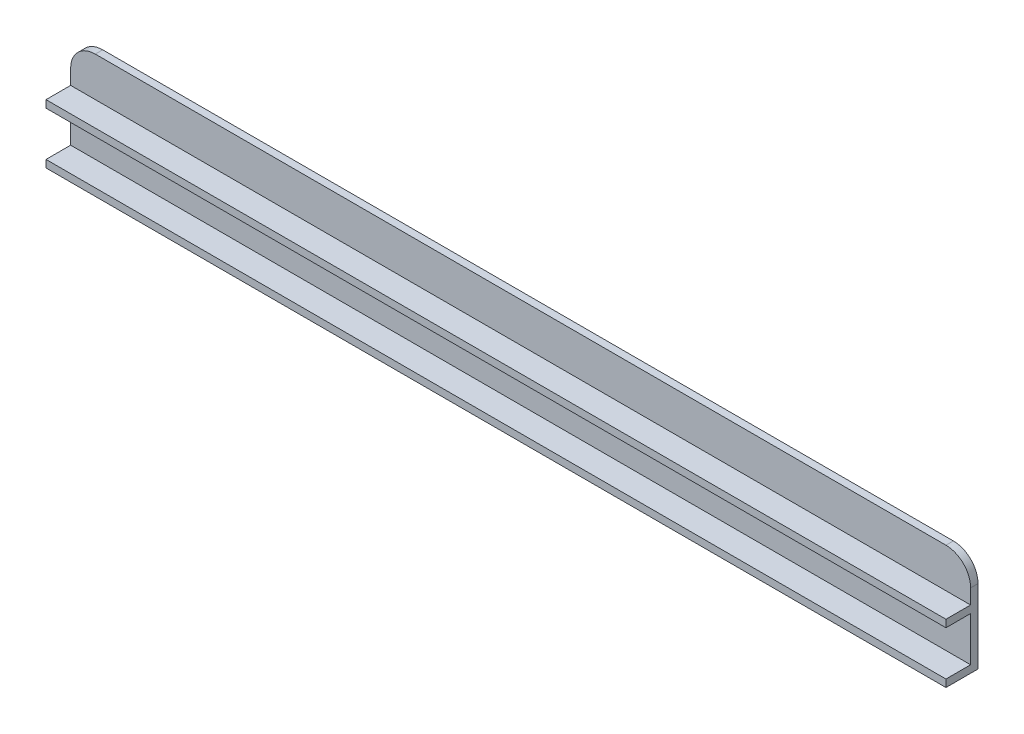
ISO-10303-21;
HEADER;
FILE_DESCRIPTION(('STEP AP214'),'2;1');
FILE_NAME('part.step','',(''),(''),'','','');
FILE_SCHEMA(('AUTOMOTIVE_DESIGN { 1 0 10303 214 1 1 1 1 }'));
ENDSEC;
DATA;
#1=APPLICATION_CONTEXT('core data for automotive mechanical design processes');
#2=APPLICATION_PROTOCOL_DEFINITION('international standard','automotive_design',2000,#1);
#3=PRODUCT_CONTEXT('',#1,'mechanical');
#4=PRODUCT('Part','Part','',(#3));
#5=PRODUCT_RELATED_PRODUCT_CATEGORY('part','',(#4));
#6=PRODUCT_DEFINITION_FORMATION('','',#4);
#7=PRODUCT_DEFINITION_CONTEXT('part definition',#1,'design');
#8=PRODUCT_DEFINITION('design','',#6,#7);
#9=PRODUCT_DEFINITION_SHAPE('','',#8);
#10=(LENGTH_UNIT() NAMED_UNIT(*) SI_UNIT(.MILLI.,.METRE.));
#11=(NAMED_UNIT(*) PLANE_ANGLE_UNIT() SI_UNIT($,.RADIAN.));
#12=(NAMED_UNIT(*) SI_UNIT($,.STERADIAN.) SOLID_ANGLE_UNIT());
#13=UNCERTAINTY_MEASURE_WITH_UNIT(LENGTH_MEASURE(1.E-05),#10,'distance_accuracy_value','');
#14=(GEOMETRIC_REPRESENTATION_CONTEXT(3) GLOBAL_UNCERTAINTY_ASSIGNED_CONTEXT((#13)) GLOBAL_UNIT_ASSIGNED_CONTEXT((#10,
#11,#12)) REPRESENTATION_CONTEXT('',''));
#15=CARTESIAN_POINT('',(0.,0.,0.));
#16=DIRECTION('',(0.,0.,1.));
#17=DIRECTION('',(1.,0.,0.));
#18=AXIS2_PLACEMENT_3D('',#15,#16,#17);
#19=CARTESIAN_POINT('',(156.500000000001,0.,296.499999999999));
#20=DIRECTION('',(1.,0.,0.));
#21=DIRECTION('',(0.,0.,-1.));
#22=AXIS2_PLACEMENT_3D('',#19,#20,#21);
#23=PLANE('',#22);
#24=DIRECTION('',(0.,1.,0.));
#25=VECTOR('',#24,1.);
#26=CARTESIAN_POINT('',(156.5,218.5,144.999999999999));
#27=LINE('',#26,#25);
#28=CARTESIAN_POINT('',(156.5,218.5,144.999999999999));
#29=VERTEX_POINT('',#28);
#30=CARTESIAN_POINT('',(156.5,233.5,144.999999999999));
#31=VERTEX_POINT('',#30);
#32=EDGE_CURVE('E145',#29,#31,#27,.T.);
#33=ORIENTED_EDGE('',*,*,#32,.T.);
#34=DIRECTION('',(0.,0.,1.));
#35=VECTOR('',#34,1.);
#36=CARTESIAN_POINT('',(156.5,233.5,146.499999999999));
#37=LINE('',#36,#35);
#38=CARTESIAN_POINT('',(156.5,233.5,146.499999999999));
#39=VERTEX_POINT('',#38);
#40=EDGE_CURVE('E11',#31,#39,#37,.T.);
#41=ORIENTED_EDGE('',*,*,#40,.T.);
#42=DIRECTION('',(0.,-1.,0.));
#43=VECTOR('',#42,1.);
#44=CARTESIAN_POINT('',(156.5,238.5,146.499999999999));
#45=LINE('',#44,#43);
#46=CARTESIAN_POINT('',(156.5,230.5,146.499999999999));
#47=VERTEX_POINT('',#46);
#48=EDGE_CURVE('E157',#39,#47,#45,.T.);
#49=ORIENTED_EDGE('',*,*,#48,.T.);
#50=DIRECTION('',(0.,0.,1.));
#51=VECTOR('',#50,1.);
#52=CARTESIAN_POINT('',(156.5,230.5,146.499999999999));
#53=LINE('',#52,#51);
#54=CARTESIAN_POINT('',(156.5,230.5,151.499999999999));
#55=VERTEX_POINT('',#54);
#56=EDGE_CURVE('E162',#47,#55,#53,.T.);
#57=ORIENTED_EDGE('',*,*,#56,.T.);
#58=DIRECTION('',(0.,-1.,0.));
#59=VECTOR('',#58,1.);
#60=CARTESIAN_POINT('',(156.5,230.5,151.499999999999));
#61=LINE('',#60,#59);
#62=CARTESIAN_POINT('',(156.5,229.,151.499999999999));
#63=VERTEX_POINT('',#62);
#64=EDGE_CURVE('E167',#55,#63,#61,.T.);
#65=ORIENTED_EDGE('',*,*,#64,.T.);
#66=DIRECTION('',(0.,0.,-1.));
#67=VECTOR('',#66,1.);
#68=CARTESIAN_POINT('',(156.5,229.,151.499999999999));
#69=LINE('',#68,#67);
#70=CARTESIAN_POINT('',(156.5,229.,146.499999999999));
#71=VERTEX_POINT('',#70);
#72=EDGE_CURVE('E172',#63,#71,#69,.T.);
#73=ORIENTED_EDGE('',*,*,#72,.T.);
#74=DIRECTION('',(0.,-1.,0.));
#75=VECTOR('',#74,1.);
#76=CARTESIAN_POINT('',(156.5,229.,146.499999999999));
#77=LINE('',#76,#75);
#78=CARTESIAN_POINT('',(156.5,220.,146.499999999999));
#79=VERTEX_POINT('',#78);
#80=EDGE_CURVE('E177',#71,#79,#77,.T.);
#81=ORIENTED_EDGE('',*,*,#80,.T.);
#82=DIRECTION('',(0.,0.,1.));
#83=VECTOR('',#82,1.);
#84=CARTESIAN_POINT('',(156.5,220.,146.499999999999));
#85=LINE('',#84,#83);
#86=CARTESIAN_POINT('',(156.5,220.,151.499999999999));
#87=VERTEX_POINT('',#86);
#88=EDGE_CURVE('E182',#79,#87,#85,.T.);
#89=ORIENTED_EDGE('',*,*,#88,.T.);
#90=DIRECTION('',(0.,-1.,0.));
#91=VECTOR('',#90,1.);
#92=CARTESIAN_POINT('',(156.5,220.,151.499999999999));
#93=LINE('',#92,#91);
#94=CARTESIAN_POINT('',(156.5,218.5,151.499999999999));
#95=VERTEX_POINT('',#94);
#96=EDGE_CURVE('E187',#87,#95,#93,.T.);
#97=ORIENTED_EDGE('',*,*,#96,.T.);
#98=DIRECTION('',(0.,0.,-1.));
#99=VECTOR('',#98,1.);
#100=CARTESIAN_POINT('',(156.5,218.5,151.499999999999));
#101=LINE('',#100,#99);
#102=EDGE_CURVE('E191',#95,#29,#101,.T.);
#103=ORIENTED_EDGE('',*,*,#102,.T.);
#104=EDGE_LOOP('',(#33,#41,#49,#57,#65,#73,#81,#89,#97,#103));
#105=FACE_BOUND('',#104,.T.);
#106=ADVANCED_FACE('F38',(#105),#23,.T.);
#107=CARTESIAN_POINT('',(-34.5,218.5,145.000000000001));
#108=DIRECTION('',(0.,0.,-1.));
#109=DIRECTION('',(-1.,0.,0.));
#110=AXIS2_PLACEMENT_3D('',#107,#108,#109);
#111=PLANE('',#110);
#112=DIRECTION('',(0.,1.,0.));
#113=VECTOR('',#112,1.);
#114=CARTESIAN_POINT('',(-26.,212.5,145.000000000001));
#115=LINE('',#114,#113);
#116=CARTESIAN_POINT('',(-26.,218.5,145.000000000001));
#117=VERTEX_POINT('',#116);
#118=CARTESIAN_POINT('',(-26.,233.5,145.000000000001));
#119=VERTEX_POINT('',#118);
#120=EDGE_CURVE('E127',#117,#119,#115,.T.);
#121=ORIENTED_EDGE('',*,*,#120,.T.);
#122=CARTESIAN_POINT('',(-21.,233.5,145.000000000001));
#123=DIRECTION('',(0.,0.,-1.));
#124=DIRECTION('',(-1.,0.,0.));
#125=AXIS2_PLACEMENT_3D('',#122,#123,#124);
#126=CIRCLE('',#125,5.);
#127=CARTESIAN_POINT('',(-21.,238.5,145.000000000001));
#128=VERTEX_POINT('',#127);
#129=EDGE_CURVE('E46',#119,#128,#126,.T.);
#130=ORIENTED_EDGE('',*,*,#129,.T.);
#131=DIRECTION('',(1.,0.,0.));
#132=VECTOR('',#131,1.);
#133=CARTESIAN_POINT('',(-34.5,238.5,145.000000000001));
#134=LINE('',#133,#132);
#135=CARTESIAN_POINT('',(151.5,238.5,144.999999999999));
#136=VERTEX_POINT('',#135);
#137=EDGE_CURVE('E148',#128,#136,#134,.T.);
#138=ORIENTED_EDGE('',*,*,#137,.T.);
#139=CARTESIAN_POINT('',(151.5,233.5,144.999999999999));
#140=DIRECTION('',(0.,0.,-1.));
#141=DIRECTION('',(-1.,0.,0.));
#142=AXIS2_PLACEMENT_3D('',#139,#140,#141);
#143=CIRCLE('',#142,5.);
#144=EDGE_CURVE('E53',#136,#31,#143,.T.);
#145=ORIENTED_EDGE('',*,*,#144,.T.);
#146=ORIENTED_EDGE('',*,*,#32,.F.);
#147=DIRECTION('',(1.,0.,0.));
#148=VECTOR('',#147,1.);
#149=CARTESIAN_POINT('',(-34.5,218.5,145.000000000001));
#150=LINE('',#149,#148);
#151=EDGE_CURVE('E139',#117,#29,#150,.T.);
#152=ORIENTED_EDGE('',*,*,#151,.F.);
#153=EDGE_LOOP('',(#121,#130,#138,#145,#146,#152));
#154=FACE_BOUND('',#153,.T.);
#155=ADVANCED_FACE('F144',(#154),#111,.T.);
#156=CARTESIAN_POINT('',(-34.4999999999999,220.,151.500000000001));
#157=DIRECTION('',(0.,0.,1.));
#158=DIRECTION('',(1.,0.,0.));
#159=AXIS2_PLACEMENT_3D('',#156,#157,#158);
#160=PLANE('',#159);
#161=DIRECTION('',(0.,1.,0.));
#162=VECTOR('',#161,1.);
#163=CARTESIAN_POINT('',(-25.9999999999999,220.,151.500000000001));
#164=LINE('',#163,#162);
#165=CARTESIAN_POINT('',(-25.9999999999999,218.5,151.500000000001));
#166=VERTEX_POINT('',#165);
#167=CARTESIAN_POINT('',(-25.9999999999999,220.,151.500000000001));
#168=VERTEX_POINT('',#167);
#169=EDGE_CURVE('E193',#166,#168,#164,.T.);
#170=ORIENTED_EDGE('',*,*,#169,.F.);
#171=DIRECTION('',(1.,0.,0.));
#172=VECTOR('',#171,1.);
#173=CARTESIAN_POINT('',(-34.4999999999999,218.5,151.500000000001));
#174=LINE('',#173,#172);
#175=EDGE_CURVE('E141',#166,#95,#174,.T.);
#176=ORIENTED_EDGE('',*,*,#175,.T.);
#177=ORIENTED_EDGE('',*,*,#96,.F.);
#178=DIRECTION('',(1.,0.,0.));
#179=VECTOR('',#178,1.);
#180=CARTESIAN_POINT('',(-34.4999999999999,220.,151.500000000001));
#181=LINE('',#180,#179);
#182=EDGE_CURVE('E185',#168,#87,#181,.T.);
#183=ORIENTED_EDGE('',*,*,#182,.F.);
#184=EDGE_LOOP('',(#170,#176,#177,#183));
#185=FACE_BOUND('',#184,.T.);
#186=ADVANCED_FACE('F239',(#185),#160,.T.);
#187=CARTESIAN_POINT('',(-34.4999999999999,218.5,151.500000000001));
#188=DIRECTION('',(0.,1.,0.));
#189=DIRECTION('',(0.,0.,-1.));
#190=AXIS2_PLACEMENT_3D('',#187,#188,#189);
#191=PLANE('',#190);
#192=ORIENTED_EDGE('',*,*,#175,.F.);
#193=DIRECTION('',(0.,0.,-1.));
#194=VECTOR('',#193,1.);
#195=CARTESIAN_POINT('',(-25.9999999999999,218.5,151.500000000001));
#196=LINE('',#195,#194);
#197=EDGE_CURVE('E130',#166,#117,#196,.T.);
#198=ORIENTED_EDGE('',*,*,#197,.T.);
#199=ORIENTED_EDGE('',*,*,#151,.T.);
#200=ORIENTED_EDGE('',*,*,#102,.F.);
#201=EDGE_LOOP('',(#192,#198,#199,#200));
#202=FACE_BOUND('',#201,.T.);
#203=ADVANCED_FACE('F137',(#202),#191,.F.);
#204=CARTESIAN_POINT('',(-34.5,229.,146.500000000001));
#205=DIRECTION('',(0.,0.,1.));
#206=DIRECTION('',(1.,0.,0.));
#207=AXIS2_PLACEMENT_3D('',#204,#205,#206);
#208=PLANE('',#207);
#209=DIRECTION('',(0.,1.,0.));
#210=VECTOR('',#209,1.);
#211=CARTESIAN_POINT('',(-26.,229.,146.500000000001));
#212=LINE('',#211,#210);
#213=CARTESIAN_POINT('',(-26.,220.,146.500000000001));
#214=VERTEX_POINT('',#213);
#215=CARTESIAN_POINT('',(-26.,229.,146.500000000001));
#216=VERTEX_POINT('',#215);
#217=EDGE_CURVE('E228',#214,#216,#212,.T.);
#218=ORIENTED_EDGE('',*,*,#217,.F.);
#219=DIRECTION('',(1.,0.,0.));
#220=VECTOR('',#219,1.);
#221=CARTESIAN_POINT('',(-34.5,220.,146.500000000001));
#222=LINE('',#221,#220);
#223=EDGE_CURVE('E180',#214,#79,#222,.T.);
#224=ORIENTED_EDGE('',*,*,#223,.T.);
#225=ORIENTED_EDGE('',*,*,#80,.F.);
#226=DIRECTION('',(1.,0.,0.));
#227=VECTOR('',#226,1.);
#228=CARTESIAN_POINT('',(-34.5,229.,146.500000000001));
#229=LINE('',#228,#227);
#230=EDGE_CURVE('E175',#216,#71,#229,.T.);
#231=ORIENTED_EDGE('',*,*,#230,.F.);
#232=EDGE_LOOP('',(#218,#224,#225,#231));
#233=FACE_BOUND('',#232,.T.);
#234=ADVANCED_FACE('F245',(#233),#208,.T.);
#235=CARTESIAN_POINT('',(-34.5,220.,146.500000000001));
#236=DIRECTION('',(0.,-1.,0.));
#237=DIRECTION('',(0.,0.,1.));
#238=AXIS2_PLACEMENT_3D('',#235,#236,#237);
#239=PLANE('',#238);
#240=ORIENTED_EDGE('',*,*,#223,.F.);
#241=DIRECTION('',(0.,0.,1.));
#242=VECTOR('',#241,1.);
#243=CARTESIAN_POINT('',(-26.,220.,146.500000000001));
#244=LINE('',#243,#242);
#245=EDGE_CURVE('E142',#214,#168,#244,.T.);
#246=ORIENTED_EDGE('',*,*,#245,.T.);
#247=ORIENTED_EDGE('',*,*,#182,.T.);
#248=ORIENTED_EDGE('',*,*,#88,.F.);
#249=EDGE_LOOP('',(#240,#246,#247,#248));
#250=FACE_BOUND('',#249,.T.);
#251=ADVANCED_FACE('F234',(#250),#239,.F.);
#252=CARTESIAN_POINT('',(-34.4999999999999,230.5,151.500000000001));
#253=DIRECTION('',(0.,0.,1.));
#254=DIRECTION('',(1.,0.,0.));
#255=AXIS2_PLACEMENT_3D('',#252,#253,#254);
#256=PLANE('',#255);
#257=DIRECTION('',(0.,1.,0.));
#258=VECTOR('',#257,1.);
#259=CARTESIAN_POINT('',(-25.9999999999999,230.5,151.500000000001));
#260=LINE('',#259,#258);
#261=CARTESIAN_POINT('',(-25.9999999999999,229.,151.500000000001));
#262=VERTEX_POINT('',#261);
#263=CARTESIAN_POINT('',(-25.9999999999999,230.5,151.500000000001));
#264=VERTEX_POINT('',#263);
#265=EDGE_CURVE('E219',#262,#264,#260,.T.);
#266=ORIENTED_EDGE('',*,*,#265,.F.);
#267=DIRECTION('',(1.,0.,0.));
#268=VECTOR('',#267,1.);
#269=CARTESIAN_POINT('',(-34.4999999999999,229.,151.500000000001));
#270=LINE('',#269,#268);
#271=EDGE_CURVE('E170',#262,#63,#270,.T.);
#272=ORIENTED_EDGE('',*,*,#271,.T.);
#273=ORIENTED_EDGE('',*,*,#64,.F.);
#274=DIRECTION('',(1.,0.,0.));
#275=VECTOR('',#274,1.);
#276=CARTESIAN_POINT('',(-34.4999999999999,230.5,151.500000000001));
#277=LINE('',#276,#275);
#278=EDGE_CURVE('E165',#264,#55,#277,.T.);
#279=ORIENTED_EDGE('',*,*,#278,.F.);
#280=EDGE_LOOP('',(#266,#272,#273,#279));
#281=FACE_BOUND('',#280,.T.);
#282=ADVANCED_FACE('F251',(#281),#256,.T.);
#283=CARTESIAN_POINT('',(-34.4999999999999,229.,151.500000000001));
#284=DIRECTION('',(0.,1.,0.));
#285=DIRECTION('',(0.,0.,-1.));
#286=AXIS2_PLACEMENT_3D('',#283,#284,#285);
#287=PLANE('',#286);
#288=ORIENTED_EDGE('',*,*,#271,.F.);
#289=DIRECTION('',(0.,0.,-1.));
#290=VECTOR('',#289,1.);
#291=CARTESIAN_POINT('',(-25.9999999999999,229.,151.500000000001));
#292=LINE('',#291,#290);
#293=EDGE_CURVE('E223',#262,#216,#292,.T.);
#294=ORIENTED_EDGE('',*,*,#293,.T.);
#295=ORIENTED_EDGE('',*,*,#230,.T.);
#296=ORIENTED_EDGE('',*,*,#72,.F.);
#297=EDGE_LOOP('',(#288,#294,#295,#296));
#298=FACE_BOUND('',#297,.T.);
#299=ADVANCED_FACE('F248',(#298),#287,.F.);
#300=CARTESIAN_POINT('',(-34.5,238.5,146.500000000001));
#301=DIRECTION('',(0.,0.,1.));
#302=DIRECTION('',(1.,0.,0.));
#303=AXIS2_PLACEMENT_3D('',#300,#301,#302);
#304=PLANE('',#303);
#305=DIRECTION('',(1.,0.,0.));
#306=VECTOR('',#305,1.);
#307=CARTESIAN_POINT('',(-34.5,238.5,146.500000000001));
#308=LINE('',#307,#306);
#309=CARTESIAN_POINT('',(-21.,238.5,146.500000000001));
#310=VERTEX_POINT('',#309);
#311=CARTESIAN_POINT('',(151.5,238.5,146.499999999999));
#312=VERTEX_POINT('',#311);
#313=EDGE_CURVE('E154',#310,#312,#308,.T.);
#314=ORIENTED_EDGE('',*,*,#313,.F.);
#315=CARTESIAN_POINT('',(-21.,233.5,146.500000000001));
#316=DIRECTION('',(0.,0.,1.));
#317=DIRECTION('',(1.,0.,0.));
#318=AXIS2_PLACEMENT_3D('',#315,#316,#317);
#319=CIRCLE('',#318,5.);
#320=CARTESIAN_POINT('',(-26.,233.5,146.500000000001));
#321=VERTEX_POINT('',#320);
#322=EDGE_CURVE('E202',#310,#321,#319,.T.);
#323=ORIENTED_EDGE('',*,*,#322,.T.);
#324=DIRECTION('',(0.,1.,0.));
#325=VECTOR('',#324,1.);
#326=CARTESIAN_POINT('',(-26.,238.5,146.500000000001));
#327=LINE('',#326,#325);
#328=CARTESIAN_POINT('',(-26.,230.5,146.500000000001));
#329=VERTEX_POINT('',#328);
#330=EDGE_CURVE('E146',#329,#321,#327,.T.);
#331=ORIENTED_EDGE('',*,*,#330,.F.);
#332=DIRECTION('',(1.,0.,0.));
#333=VECTOR('',#332,1.);
#334=CARTESIAN_POINT('',(-34.5,230.5,146.500000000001));
#335=LINE('',#334,#333);
#336=EDGE_CURVE('E159',#329,#47,#335,.T.);
#337=ORIENTED_EDGE('',*,*,#336,.T.);
#338=ORIENTED_EDGE('',*,*,#48,.F.);
#339=CARTESIAN_POINT('',(151.5,233.5,146.499999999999));
#340=DIRECTION('',(0.,0.,1.));
#341=DIRECTION('',(1.,0.,0.));
#342=AXIS2_PLACEMENT_3D('',#339,#340,#341);
#343=CIRCLE('',#342,5.);
#344=EDGE_CURVE('E200',#39,#312,#343,.T.);
#345=ORIENTED_EDGE('',*,*,#344,.T.);
#346=EDGE_LOOP('',(#314,#323,#331,#337,#338,#345));
#347=FACE_BOUND('',#346,.T.);
#348=ADVANCED_FACE('F215',(#347),#304,.T.);
#349=CARTESIAN_POINT('',(-34.5,230.5,146.500000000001));
#350=DIRECTION('',(0.,-1.,0.));
#351=DIRECTION('',(0.,0.,1.));
#352=AXIS2_PLACEMENT_3D('',#349,#350,#351);
#353=PLANE('',#352);
#354=ORIENTED_EDGE('',*,*,#336,.F.);
#355=DIRECTION('',(0.,0.,1.));
#356=VECTOR('',#355,1.);
#357=CARTESIAN_POINT('',(-26.,230.5,146.500000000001));
#358=LINE('',#357,#356);
#359=EDGE_CURVE('E150',#329,#264,#358,.T.);
#360=ORIENTED_EDGE('',*,*,#359,.T.);
#361=ORIENTED_EDGE('',*,*,#278,.T.);
#362=ORIENTED_EDGE('',*,*,#56,.F.);
#363=EDGE_LOOP('',(#354,#360,#361,#362));
#364=FACE_BOUND('',#363,.T.);
#365=ADVANCED_FACE('F254',(#364),#353,.F.);
#366=CARTESIAN_POINT('',(-34.5,238.5,145.000000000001));
#367=DIRECTION('',(0.,-1.,0.));
#368=DIRECTION('',(0.,0.,1.));
#369=AXIS2_PLACEMENT_3D('',#366,#367,#368);
#370=PLANE('',#369);
#371=ORIENTED_EDGE('',*,*,#137,.F.);
#372=DIRECTION('',(0.,0.,1.));
#373=VECTOR('',#372,1.);
#374=CARTESIAN_POINT('',(-21.,238.5,145.000000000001));
#375=LINE('',#374,#373);
#376=EDGE_CURVE('E197',#128,#310,#375,.T.);
#377=ORIENTED_EDGE('',*,*,#376,.T.);
#378=ORIENTED_EDGE('',*,*,#313,.T.);
#379=DIRECTION('',(0.,0.,1.));
#380=VECTOR('',#379,1.);
#381=CARTESIAN_POINT('',(151.5,238.5,144.999999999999));
#382=LINE('',#381,#380);
#383=EDGE_CURVE('E195',#312,#136,#382,.F.);
#384=ORIENTED_EDGE('',*,*,#383,.T.);
#385=EDGE_LOOP('',(#371,#377,#378,#384));
#386=FACE_BOUND('',#385,.T.);
#387=ADVANCED_FACE('F209',(#386),#370,.F.);
#388=CARTESIAN_POINT('',(-26.,212.5,145.000000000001));
#389=DIRECTION('',(1.,0.,0.));
#390=DIRECTION('',(0.,0.,-1.));
#391=AXIS2_PLACEMENT_3D('',#388,#389,#390);
#392=PLANE('',#391);
#393=ORIENTED_EDGE('',*,*,#330,.T.);
#394=DIRECTION('',(0.,0.,1.));
#395=VECTOR('',#394,1.);
#396=CARTESIAN_POINT('',(-26.,233.5,145.000000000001));
#397=LINE('',#396,#395);
#398=EDGE_CURVE('E61',#321,#119,#397,.F.);
#399=ORIENTED_EDGE('',*,*,#398,.T.);
#400=ORIENTED_EDGE('',*,*,#120,.F.);
#401=ORIENTED_EDGE('',*,*,#197,.F.);
#402=ORIENTED_EDGE('',*,*,#169,.T.);
#403=ORIENTED_EDGE('',*,*,#245,.F.);
#404=ORIENTED_EDGE('',*,*,#217,.T.);
#405=ORIENTED_EDGE('',*,*,#293,.F.);
#406=ORIENTED_EDGE('',*,*,#265,.T.);
#407=ORIENTED_EDGE('',*,*,#359,.F.);
#408=EDGE_LOOP('',(#393,#399,#400,#401,#402,#403,#404,#405,#406,#407));
#409=FACE_BOUND('',#408,.T.);
#410=ADVANCED_FACE('F129',(#409),#392,.F.);
#411=CARTESIAN_POINT('',(-21.,233.5,145.000000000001));
#412=DIRECTION('',(0.,0.,1.));
#413=DIRECTION('',(1.,0.,0.));
#414=AXIS2_PLACEMENT_3D('',#411,#412,#413);
#415=CYLINDRICAL_SURFACE('',#414,5.);
#416=ORIENTED_EDGE('',*,*,#129,.F.);
#417=ORIENTED_EDGE('',*,*,#398,.F.);
#418=ORIENTED_EDGE('',*,*,#322,.F.);
#419=ORIENTED_EDGE('',*,*,#376,.F.);
#420=EDGE_LOOP('',(#416,#417,#418,#419));
#421=FACE_BOUND('',#420,.T.);
#422=ADVANCED_FACE('F212',(#421),#415,.T.);
#423=CARTESIAN_POINT('',(151.500000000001,233.5,296.499999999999));
#424=DIRECTION('',(0.,0.,-1.));
#425=DIRECTION('',(-1.,0.,0.));
#426=AXIS2_PLACEMENT_3D('',#423,#424,#425);
#427=CYLINDRICAL_SURFACE('',#426,5.);
#428=ORIENTED_EDGE('',*,*,#144,.F.);
#429=ORIENTED_EDGE('',*,*,#383,.F.);
#430=ORIENTED_EDGE('',*,*,#344,.F.);
#431=ORIENTED_EDGE('',*,*,#40,.F.);
#432=EDGE_LOOP('',(#428,#429,#430,#431));
#433=FACE_BOUND('',#432,.T.);
#434=ADVANCED_FACE('F40',(#433),#427,.T.);
#435=CLOSED_SHELL('',(#106,#155,#186,#203,#234,#251,#282,#299,#348,#365,#387,#410,#422,#434));
#436=MANIFOLD_SOLID_BREP('B2',#435);
#437=ADVANCED_BREP_SHAPE_REPRESENTATION('',(#18,#436),#14);
#438=SHAPE_DEFINITION_REPRESENTATION(#9,#437);
ENDSEC;
END-ISO-10303-21;
